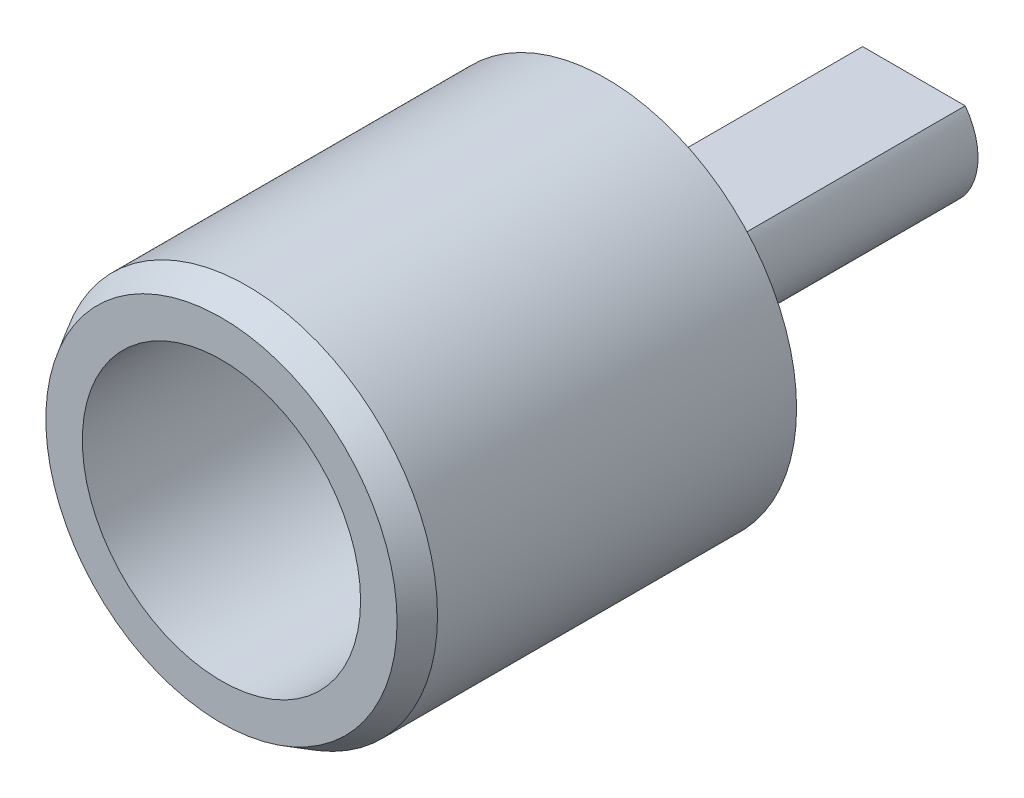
from build123d import *

# Parameters (mm, degrees)
BOSS_EXTRUDE1_DEPTH = 12
SKETCH4_R           = 7.425
BOSS_EXTRUDE2_DEPTH = 15
SKETCH7_R           = 5.425
CUT_EXTRUDE2_DEPTH  = 14.5
CHAMFER3_SIZE       = 1
CHAMFER3_SIZE2      = 0.577350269


with BuildPart() as part:
    # Sketch1 → Boss-Extrude1 (new body)
    with BuildSketch(Plane.XY):
        with BuildLine():
            Line((-2, 1.5), (2, 1.5))
            ThreePointArc((2, 1.5), (0, -2.5), (-2, 1.5))
        make_face()
    extrude(amount=-BOSS_EXTRUDE1_DEPTH)

    # Sketch4 → Boss-Extrude2 (add)
    with BuildSketch(Plane.XY):
        Circle(SKETCH4_R)
    extrude(amount=BOSS_EXTRUDE2_DEPTH)

    # Sketch7 → Cut-Extrude2 (cut)
    with BuildSketch(Plane.XY.offset(15)):
        Circle(SKETCH7_R)
    extrude(amount=-CUT_EXTRUDE2_DEPTH, mode=Mode.SUBTRACT)

    # Chamfer3
    chamfer3_edges = [part.edges().sort_by_distance(p)[0] for p in [
        (-7.425, 0, 15),
    ]]
    chamfer3_side = [part.faces().sort_by_distance(p)[0] for p in [
        (-7.425, 0, 7.5),
    ]]
    chamfer(chamfer3_edges, length=CHAMFER3_SIZE, length2=CHAMFER3_SIZE2, reference=chamfer3_side[0])


solid = part.part
